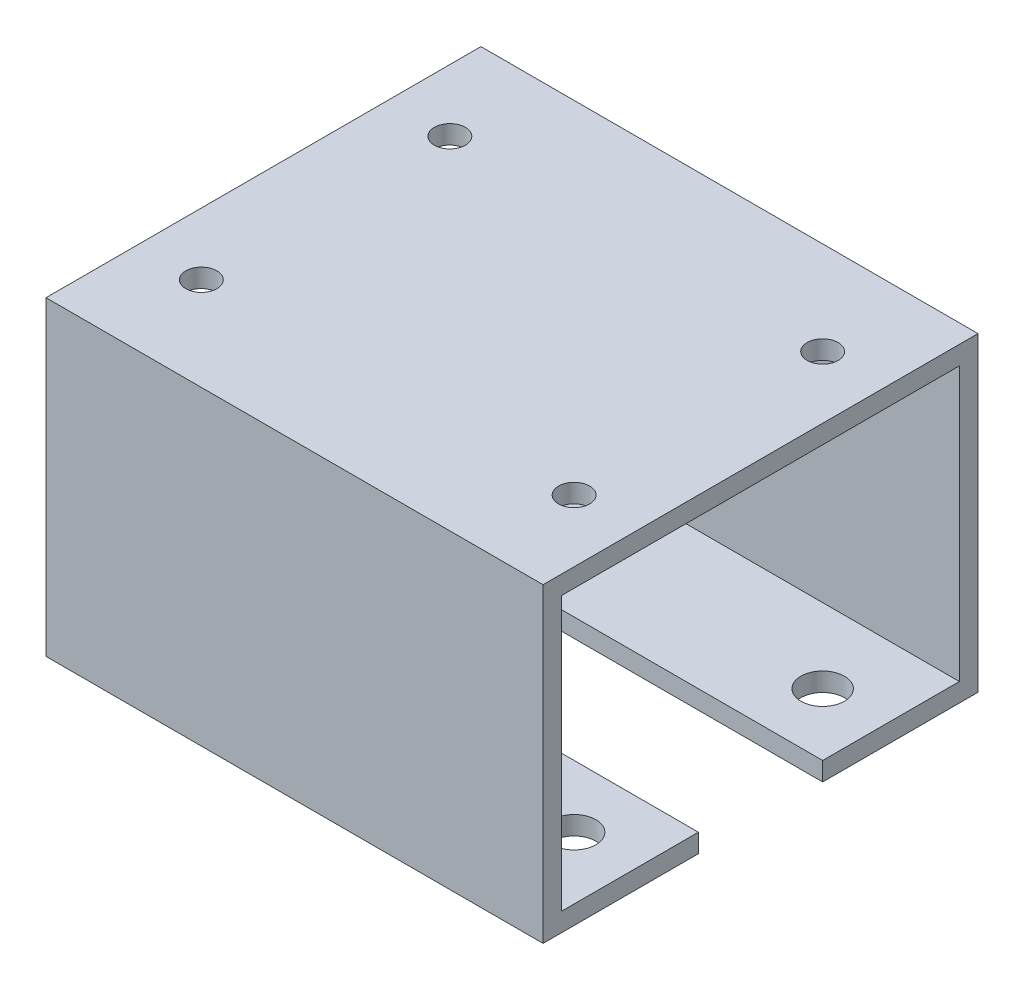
from build123d import *

# Parameters (mm, degrees)
SKETCH_3_W          = 80
SKETCH_3_H          = 70
EXTRUDE_1_DEPTH     = 50
SHELL_1_T           = -3
CUT_EXTRUDE_1_REACH = 74.973
SKETCH_4_W          = 80
SKETCH_4_H          = 20
SKETCH_5_R          = 3.5
CUT_EXTRUDE_2_DEPTH = 71.9506871
M6X1_0_2_D          = 5


with BuildPart() as part:
    # Sketch 3 → Extrude 1 (new body)
    with BuildSketch(Plane(origin=(0, 0, 0), x_dir=(1, 0, 0), z_dir=(0, 1, 0))):
        Rectangle(SKETCH_3_W, SKETCH_3_H)
    extrude(amount=EXTRUDE_1_DEPTH)

    # Shell 1
    shell_1_openings = [part.faces().sort_by_distance(p)[0] for p in [
        (-40, 25, 0),
        (40, 25, 0),
    ]]
    offset(amount=SHELL_1_T, openings=shell_1_openings, kind=Kind.INTERSECTION)

    # Sketch 4 → Cut-Extrude 1 (cut, up to next)
    with BuildSketch(Plane(origin=(0, 0, 0), x_dir=(1, 0, 0), z_dir=(0, 1, 0)), mode=Mode.PRIVATE) as cut_extrude_1_sk1:
        Rectangle(SKETCH_4_W, SKETCH_4_H)
    cut_extrude_1_tool1 = extrude(cut_extrude_1_sk1.sketch, amount=CUT_EXTRUDE_1_REACH, mode=Mode.PRIVATE) & part.part
    add(cut_extrude_1_tool1.solids().sort_by_distance((0, 0, 0))[0], mode=Mode.SUBTRACT)

    # Sketch 5 → Cut-Extrude 2 (cut, through all)
    with BuildSketch(Plane(origin=(0, 3, 0), x_dir=(1, 0, 0), z_dir=(0, 1, 0))):
        with Locations(Location((30, -20, 0), (0, 0, 270))):
            Circle(SKETCH_5_R)
        with Locations(Location((-30, -20, 0), (0, 0, 270))):
            Circle(SKETCH_5_R)
        with Locations(Location((-30, 20, 0), (0, 0, 270))):
            Circle(SKETCH_5_R)
        with Locations(Location((30, 20, 0), (0, 0, 270))):
            Circle(SKETCH_5_R)
    extrude(amount=-CUT_EXTRUDE_2_DEPTH, mode=Mode.SUBTRACT)

    # M6x1.0 _2 (through all)
    with Locations(Plane(origin=(0, 50, 0), x_dir=(-1, 0, 0), z_dir=(0, 1, 0))):
        with Locations((30, -20), (30, 20), (-30, 20), (-30, -20)):
            Hole(M6X1_0_2_D / 2)


solid = part.part
